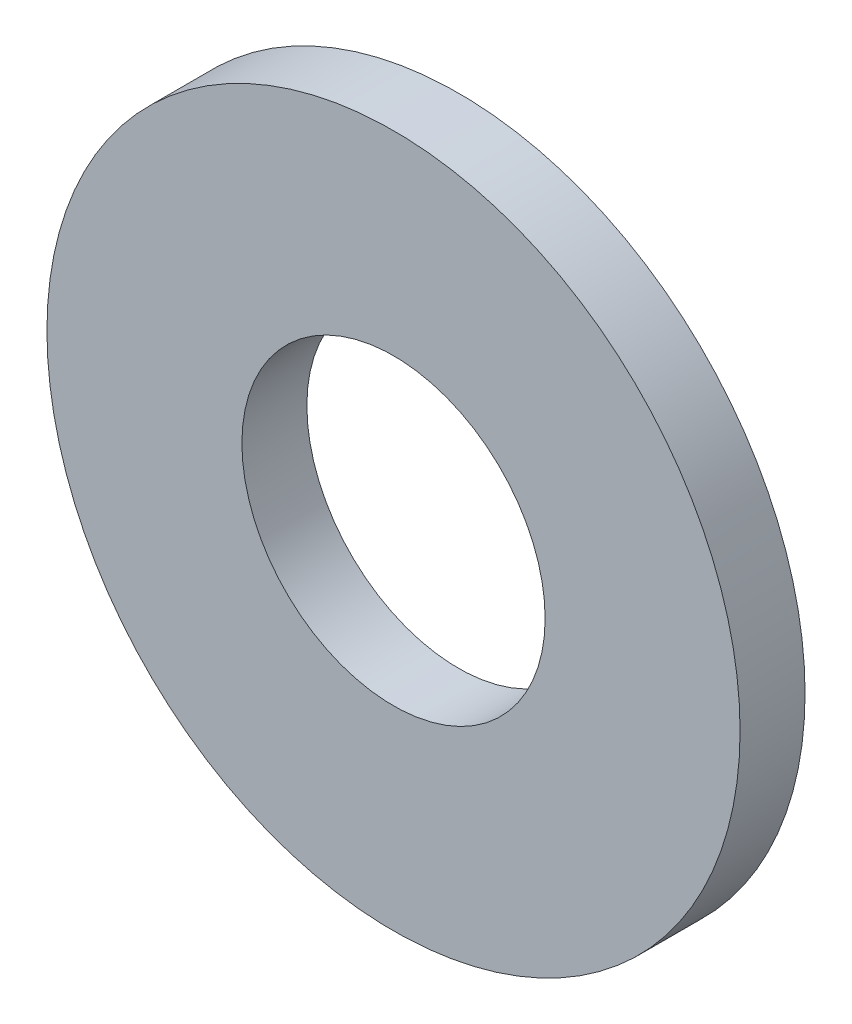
from build123d import *

# Parameters (mm, degrees)
SKETCH1_R    = 6.35
SKETCH1_R_2  = 2.778125
WASHER_DEPTH = 1.190625


with BuildPart() as part:
    # Sketch1 → Washer (new body)
    with BuildSketch(Plane.XY):
        with Locations(Location((0, 0, 0), (0, 0, 180))):
            Circle(SKETCH1_R)
        with Locations(Location((0, 0, 0), (0, 0, 180))):
            Circle(SKETCH1_R_2, mode=Mode.SUBTRACT)
    extrude(amount=WASHER_DEPTH)


solid = part.part
